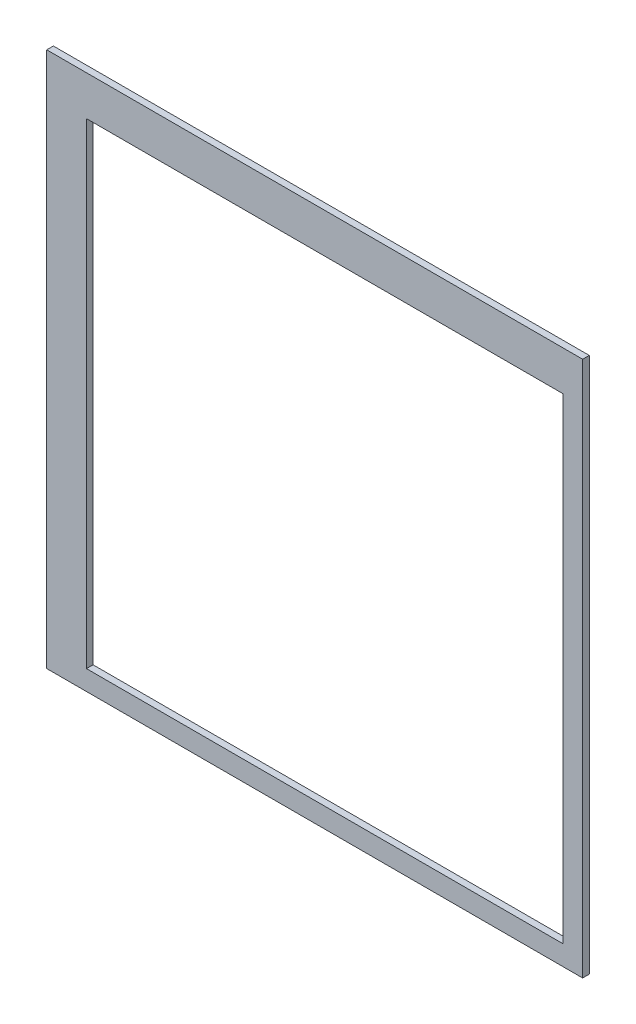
ISO-10303-21;
HEADER;
FILE_DESCRIPTION(('STEP AP214'),'2;1');
FILE_NAME('part.step','',(''),(''),'','','');
FILE_SCHEMA(('AUTOMOTIVE_DESIGN { 1 0 10303 214 1 1 1 1 }'));
ENDSEC;
DATA;
#1=APPLICATION_CONTEXT('core data for automotive mechanical design processes');
#2=APPLICATION_PROTOCOL_DEFINITION('international standard','automotive_design',2000,#1);
#3=PRODUCT_CONTEXT('',#1,'mechanical');
#4=PRODUCT('Part','Part','',(#3));
#5=PRODUCT_RELATED_PRODUCT_CATEGORY('part','',(#4));
#6=PRODUCT_DEFINITION_FORMATION('','',#4);
#7=PRODUCT_DEFINITION_CONTEXT('part definition',#1,'design');
#8=PRODUCT_DEFINITION('design','',#6,#7);
#9=PRODUCT_DEFINITION_SHAPE('','',#8);
#10=(LENGTH_UNIT() NAMED_UNIT(*) SI_UNIT(.MILLI.,.METRE.));
#11=(NAMED_UNIT(*) PLANE_ANGLE_UNIT() SI_UNIT($,.RADIAN.));
#12=(NAMED_UNIT(*) SI_UNIT($,.STERADIAN.) SOLID_ANGLE_UNIT());
#13=UNCERTAINTY_MEASURE_WITH_UNIT(LENGTH_MEASURE(1.E-05),#10,'distance_accuracy_value','');
#14=(GEOMETRIC_REPRESENTATION_CONTEXT(3) GLOBAL_UNCERTAINTY_ASSIGNED_CONTEXT((#13)) GLOBAL_UNIT_ASSIGNED_CONTEXT((#10,
#11,#12)) REPRESENTATION_CONTEXT('',''));
#15=CARTESIAN_POINT('',(0.,0.,0.));
#16=DIRECTION('',(0.,0.,1.));
#17=DIRECTION('',(1.,0.,0.));
#18=AXIS2_PLACEMENT_3D('',#15,#16,#17);
#19=CARTESIAN_POINT('',(0.,0.,2.5));
#20=DIRECTION('',(0.,0.,-1.));
#21=DIRECTION('',(-1.,0.,0.));
#22=AXIS2_PLACEMENT_3D('',#19,#20,#21);
#23=PLANE('',#22);
#24=DIRECTION('',(1.,0.,0.));
#25=VECTOR('',#24,1.);
#26=CARTESIAN_POINT('',(195.,-195.,2.5));
#27=LINE('',#26,#25);
#28=CARTESIAN_POINT('',(-210.,-195.,2.5));
#29=VERTEX_POINT('',#28);
#30=CARTESIAN_POINT('',(195.,-195.,2.5));
#31=VERTEX_POINT('',#30);
#32=EDGE_CURVE('E134',#29,#31,#27,.T.);
#33=ORIENTED_EDGE('',*,*,#32,.T.);
#34=DIRECTION('',(0.,1.,0.));
#35=VECTOR('',#34,1.);
#36=CARTESIAN_POINT('',(195.,-195.,2.5));
#37=LINE('',#36,#35);
#38=CARTESIAN_POINT('',(195.,210.,2.5));
#39=VERTEX_POINT('',#38);
#40=EDGE_CURVE('E137',#31,#39,#37,.T.);
#41=ORIENTED_EDGE('',*,*,#40,.T.);
#42=DIRECTION('',(-1.,0.,0.));
#43=VECTOR('',#42,1.);
#44=CARTESIAN_POINT('',(195.,210.,2.5));
#45=LINE('',#44,#43);
#46=CARTESIAN_POINT('',(-210.,210.,2.5));
#47=VERTEX_POINT('',#46);
#48=EDGE_CURVE('E140',#39,#47,#45,.T.);
#49=ORIENTED_EDGE('',*,*,#48,.T.);
#50=DIRECTION('',(0.,-1.,0.));
#51=VECTOR('',#50,1.);
#52=CARTESIAN_POINT('',(-210.,-195.,2.5));
#53=LINE('',#52,#51);
#54=EDGE_CURVE('E142',#47,#29,#53,.T.);
#55=ORIENTED_EDGE('',*,*,#54,.T.);
#56=EDGE_LOOP('',(#33,#41,#49,#55));
#57=FACE_BOUND('',#56,.T.);
#58=DIRECTION('',(0.,-1.,0.));
#59=VECTOR('',#58,1.);
#60=CARTESIAN_POINT('',(-180.,-180.,2.5));
#61=LINE('',#60,#59);
#62=CARTESIAN_POINT('',(-180.,180.,2.5));
#63=VERTEX_POINT('',#62);
#64=CARTESIAN_POINT('',(-180.,-180.,2.5));
#65=VERTEX_POINT('',#64);
#66=EDGE_CURVE('E98',#63,#65,#61,.T.);
#67=ORIENTED_EDGE('',*,*,#66,.F.);
#68=DIRECTION('',(-1.,0.,0.));
#69=VECTOR('',#68,1.);
#70=CARTESIAN_POINT('',(180.,180.,2.5));
#71=LINE('',#70,#69);
#72=CARTESIAN_POINT('',(180.,180.,2.5));
#73=VERTEX_POINT('',#72);
#74=EDGE_CURVE('E120',#73,#63,#71,.T.);
#75=ORIENTED_EDGE('',*,*,#74,.F.);
#76=DIRECTION('',(0.,1.,0.));
#77=VECTOR('',#76,1.);
#78=CARTESIAN_POINT('',(180.,-180.,2.5));
#79=LINE('',#78,#77);
#80=CARTESIAN_POINT('',(180.,-180.,2.5));
#81=VERTEX_POINT('',#80);
#82=EDGE_CURVE('E118',#81,#73,#79,.T.);
#83=ORIENTED_EDGE('',*,*,#82,.F.);
#84=DIRECTION('',(1.,0.,0.));
#85=VECTOR('',#84,1.);
#86=CARTESIAN_POINT('',(180.,-180.,2.5));
#87=LINE('',#86,#85);
#88=EDGE_CURVE('E106',#65,#81,#87,.T.);
#89=ORIENTED_EDGE('',*,*,#88,.F.);
#90=EDGE_LOOP('',(#67,#75,#83,#89));
#91=FACE_BOUND('',#90,.T.);
#92=ADVANCED_FACE('F33',(#57,#91),#23,.F.);
#93=CARTESIAN_POINT('',(0.,0.,-2.5));
#94=DIRECTION('',(0.,0.,-1.));
#95=DIRECTION('',(-1.,0.,0.));
#96=AXIS2_PLACEMENT_3D('',#93,#94,#95);
#97=PLANE('',#96);
#98=DIRECTION('',(1.,0.,0.));
#99=VECTOR('',#98,1.);
#100=CARTESIAN_POINT('',(195.,-195.,-2.5));
#101=LINE('',#100,#99);
#102=CARTESIAN_POINT('',(-210.,-195.,-2.5));
#103=VERTEX_POINT('',#102);
#104=CARTESIAN_POINT('',(195.,-195.,-2.5));
#105=VERTEX_POINT('',#104);
#106=EDGE_CURVE('E114',#103,#105,#101,.T.);
#107=ORIENTED_EDGE('',*,*,#106,.F.);
#108=DIRECTION('',(0.,-1.,0.));
#109=VECTOR('',#108,1.);
#110=CARTESIAN_POINT('',(-210.,-195.,-2.5));
#111=LINE('',#110,#109);
#112=CARTESIAN_POINT('',(-210.,210.,-2.5));
#113=VERTEX_POINT('',#112);
#114=EDGE_CURVE('E138',#113,#103,#111,.T.);
#115=ORIENTED_EDGE('',*,*,#114,.F.);
#116=DIRECTION('',(-1.,0.,0.));
#117=VECTOR('',#116,1.);
#118=CARTESIAN_POINT('',(195.,210.,-2.5));
#119=LINE('',#118,#117);
#120=CARTESIAN_POINT('',(195.,210.,-2.5));
#121=VERTEX_POINT('',#120);
#122=EDGE_CURVE('E149',#121,#113,#119,.T.);
#123=ORIENTED_EDGE('',*,*,#122,.F.);
#124=DIRECTION('',(0.,1.,0.));
#125=VECTOR('',#124,1.);
#126=CARTESIAN_POINT('',(195.,-195.,-2.5));
#127=LINE('',#126,#125);
#128=EDGE_CURVE('E147',#105,#121,#127,.T.);
#129=ORIENTED_EDGE('',*,*,#128,.F.);
#130=EDGE_LOOP('',(#107,#115,#123,#129));
#131=FACE_BOUND('',#130,.T.);
#132=DIRECTION('',(-1.,0.,0.));
#133=VECTOR('',#132,1.);
#134=CARTESIAN_POINT('',(180.,180.,-2.5));
#135=LINE('',#134,#133);
#136=CARTESIAN_POINT('',(180.,180.,-2.5));
#137=VERTEX_POINT('',#136);
#138=CARTESIAN_POINT('',(-180.,180.,-2.5));
#139=VERTEX_POINT('',#138);
#140=EDGE_CURVE('E107',#137,#139,#135,.T.);
#141=ORIENTED_EDGE('',*,*,#140,.T.);
#142=DIRECTION('',(0.,-1.,0.));
#143=VECTOR('',#142,1.);
#144=CARTESIAN_POINT('',(-180.,-180.,-2.5));
#145=LINE('',#144,#143);
#146=CARTESIAN_POINT('',(-180.,-180.,-2.5));
#147=VERTEX_POINT('',#146);
#148=EDGE_CURVE('E56',#139,#147,#145,.T.);
#149=ORIENTED_EDGE('',*,*,#148,.T.);
#150=DIRECTION('',(1.,0.,0.));
#151=VECTOR('',#150,1.);
#152=CARTESIAN_POINT('',(180.,-180.,-2.5));
#153=LINE('',#152,#151);
#154=CARTESIAN_POINT('',(180.,-180.,-2.5));
#155=VERTEX_POINT('',#154);
#156=EDGE_CURVE('E113',#147,#155,#153,.T.);
#157=ORIENTED_EDGE('',*,*,#156,.T.);
#158=DIRECTION('',(0.,1.,0.));
#159=VECTOR('',#158,1.);
#160=CARTESIAN_POINT('',(180.,-180.,-2.5));
#161=LINE('',#160,#159);
#162=EDGE_CURVE('E126',#155,#137,#161,.T.);
#163=ORIENTED_EDGE('',*,*,#162,.T.);
#164=EDGE_LOOP('',(#141,#149,#157,#163));
#165=FACE_BOUND('',#164,.T.);
#166=ADVANCED_FACE('F167',(#131,#165),#97,.T.);
#167=CARTESIAN_POINT('',(195.,-195.,2.5));
#168=DIRECTION('',(0.,1.,0.));
#169=DIRECTION('',(-1.,0.,0.));
#170=AXIS2_PLACEMENT_3D('',#167,#168,#169);
#171=PLANE('',#170);
#172=ORIENTED_EDGE('',*,*,#106,.T.);
#173=DIRECTION('',(0.,0.,-1.));
#174=VECTOR('',#173,1.);
#175=CARTESIAN_POINT('',(195.,-195.,2.5));
#176=LINE('',#175,#174);
#177=EDGE_CURVE('E11',#31,#105,#176,.T.);
#178=ORIENTED_EDGE('',*,*,#177,.F.);
#179=ORIENTED_EDGE('',*,*,#32,.F.);
#180=DIRECTION('',(0.,0.,-1.));
#181=VECTOR('',#180,1.);
#182=CARTESIAN_POINT('',(-210.,-195.,2.5));
#183=LINE('',#182,#181);
#184=EDGE_CURVE('E144',#29,#103,#183,.T.);
#185=ORIENTED_EDGE('',*,*,#184,.T.);
#186=EDGE_LOOP('',(#172,#178,#179,#185));
#187=FACE_BOUND('',#186,.T.);
#188=ADVANCED_FACE('F35',(#187),#171,.F.);
#189=CARTESIAN_POINT('',(195.,-195.,2.5));
#190=DIRECTION('',(-1.,0.,0.));
#191=DIRECTION('',(0.,0.,1.));
#192=AXIS2_PLACEMENT_3D('',#189,#190,#191);
#193=PLANE('',#192);
#194=ORIENTED_EDGE('',*,*,#128,.T.);
#195=DIRECTION('',(0.,0.,-1.));
#196=VECTOR('',#195,1.);
#197=CARTESIAN_POINT('',(195.,210.,2.5));
#198=LINE('',#197,#196);
#199=EDGE_CURVE('E41',#39,#121,#198,.T.);
#200=ORIENTED_EDGE('',*,*,#199,.F.);
#201=ORIENTED_EDGE('',*,*,#40,.F.);
#202=ORIENTED_EDGE('',*,*,#177,.T.);
#203=EDGE_LOOP('',(#194,#200,#201,#202));
#204=FACE_BOUND('',#203,.T.);
#205=ADVANCED_FACE('F177',(#204),#193,.F.);
#206=CARTESIAN_POINT('',(195.,210.,2.5));
#207=DIRECTION('',(0.,-1.,0.));
#208=DIRECTION('',(1.,0.,0.));
#209=AXIS2_PLACEMENT_3D('',#206,#207,#208);
#210=PLANE('',#209);
#211=ORIENTED_EDGE('',*,*,#122,.T.);
#212=DIRECTION('',(0.,0.,-1.));
#213=VECTOR('',#212,1.);
#214=CARTESIAN_POINT('',(-210.,210.,2.5));
#215=LINE('',#214,#213);
#216=EDGE_CURVE('E154',#47,#113,#215,.T.);
#217=ORIENTED_EDGE('',*,*,#216,.F.);
#218=ORIENTED_EDGE('',*,*,#48,.F.);
#219=ORIENTED_EDGE('',*,*,#199,.T.);
#220=EDGE_LOOP('',(#211,#217,#218,#219));
#221=FACE_BOUND('',#220,.T.);
#222=ADVANCED_FACE('F161',(#221),#210,.F.);
#223=CARTESIAN_POINT('',(-210.,-195.,2.5));
#224=DIRECTION('',(1.,0.,0.));
#225=DIRECTION('',(0.,1.,0.));
#226=AXIS2_PLACEMENT_3D('',#223,#224,#225);
#227=PLANE('',#226);
#228=ORIENTED_EDGE('',*,*,#114,.T.);
#229=ORIENTED_EDGE('',*,*,#184,.F.);
#230=ORIENTED_EDGE('',*,*,#54,.F.);
#231=ORIENTED_EDGE('',*,*,#216,.T.);
#232=EDGE_LOOP('',(#228,#229,#230,#231));
#233=FACE_BOUND('',#232,.T.);
#234=ADVANCED_FACE('F171',(#233),#227,.F.);
#235=CARTESIAN_POINT('',(-180.,-180.,2.5));
#236=DIRECTION('',(1.,0.,0.));
#237=DIRECTION('',(0.,0.,-1.));
#238=AXIS2_PLACEMENT_3D('',#235,#236,#237);
#239=PLANE('',#238);
#240=ORIENTED_EDGE('',*,*,#148,.F.);
#241=DIRECTION('',(0.,0.,-1.));
#242=VECTOR('',#241,1.);
#243=CARTESIAN_POINT('',(-180.,180.,2.5));
#244=LINE('',#243,#242);
#245=EDGE_CURVE('E102',#63,#139,#244,.T.);
#246=ORIENTED_EDGE('',*,*,#245,.F.);
#247=ORIENTED_EDGE('',*,*,#66,.T.);
#248=DIRECTION('',(0.,0.,-1.));
#249=VECTOR('',#248,1.);
#250=CARTESIAN_POINT('',(-180.,-180.,2.5));
#251=LINE('',#250,#249);
#252=EDGE_CURVE('E101',#65,#147,#251,.T.);
#253=ORIENTED_EDGE('',*,*,#252,.T.);
#254=EDGE_LOOP('',(#240,#246,#247,#253));
#255=FACE_BOUND('',#254,.T.);
#256=ADVANCED_FACE('F100',(#255),#239,.T.);
#257=CARTESIAN_POINT('',(180.,-180.,2.5));
#258=DIRECTION('',(0.,1.,0.));
#259=DIRECTION('',(-1.,0.,0.));
#260=AXIS2_PLACEMENT_3D('',#257,#258,#259);
#261=PLANE('',#260);
#262=ORIENTED_EDGE('',*,*,#156,.F.);
#263=ORIENTED_EDGE('',*,*,#252,.F.);
#264=ORIENTED_EDGE('',*,*,#88,.T.);
#265=DIRECTION('',(0.,0.,-1.));
#266=VECTOR('',#265,1.);
#267=CARTESIAN_POINT('',(180.,-180.,2.5));
#268=LINE('',#267,#266);
#269=EDGE_CURVE('E115',#81,#155,#268,.T.);
#270=ORIENTED_EDGE('',*,*,#269,.T.);
#271=EDGE_LOOP('',(#262,#263,#264,#270));
#272=FACE_BOUND('',#271,.T.);
#273=ADVANCED_FACE('F110',(#272),#261,.T.);
#274=CARTESIAN_POINT('',(180.,-180.,2.5));
#275=DIRECTION('',(-1.,0.,0.));
#276=DIRECTION('',(0.,0.,1.));
#277=AXIS2_PLACEMENT_3D('',#274,#275,#276);
#278=PLANE('',#277);
#279=ORIENTED_EDGE('',*,*,#162,.F.);
#280=ORIENTED_EDGE('',*,*,#269,.F.);
#281=ORIENTED_EDGE('',*,*,#82,.T.);
#282=DIRECTION('',(0.,0.,-1.));
#283=VECTOR('',#282,1.);
#284=CARTESIAN_POINT('',(180.,180.,2.5));
#285=LINE('',#284,#283);
#286=EDGE_CURVE('E48',#73,#137,#285,.T.);
#287=ORIENTED_EDGE('',*,*,#286,.T.);
#288=EDGE_LOOP('',(#279,#280,#281,#287));
#289=FACE_BOUND('',#288,.T.);
#290=ADVANCED_FACE('F200',(#289),#278,.T.);
#291=CARTESIAN_POINT('',(180.,180.,2.5));
#292=DIRECTION('',(0.,-1.,0.));
#293=DIRECTION('',(1.,0.,0.));
#294=AXIS2_PLACEMENT_3D('',#291,#292,#293);
#295=PLANE('',#294);
#296=ORIENTED_EDGE('',*,*,#140,.F.);
#297=ORIENTED_EDGE('',*,*,#286,.F.);
#298=ORIENTED_EDGE('',*,*,#74,.T.);
#299=ORIENTED_EDGE('',*,*,#245,.T.);
#300=EDGE_LOOP('',(#296,#297,#298,#299));
#301=FACE_BOUND('',#300,.T.);
#302=ADVANCED_FACE('F204',(#301),#295,.T.);
#303=CLOSED_SHELL('',(#92,#166,#188,#205,#222,#234,#256,#273,#290,#302));
#304=MANIFOLD_SOLID_BREP('B2',#303);
#305=ADVANCED_BREP_SHAPE_REPRESENTATION('',(#18,#304),#14);
#306=SHAPE_DEFINITION_REPRESENTATION(#9,#305);
ENDSEC;
END-ISO-10303-21;
